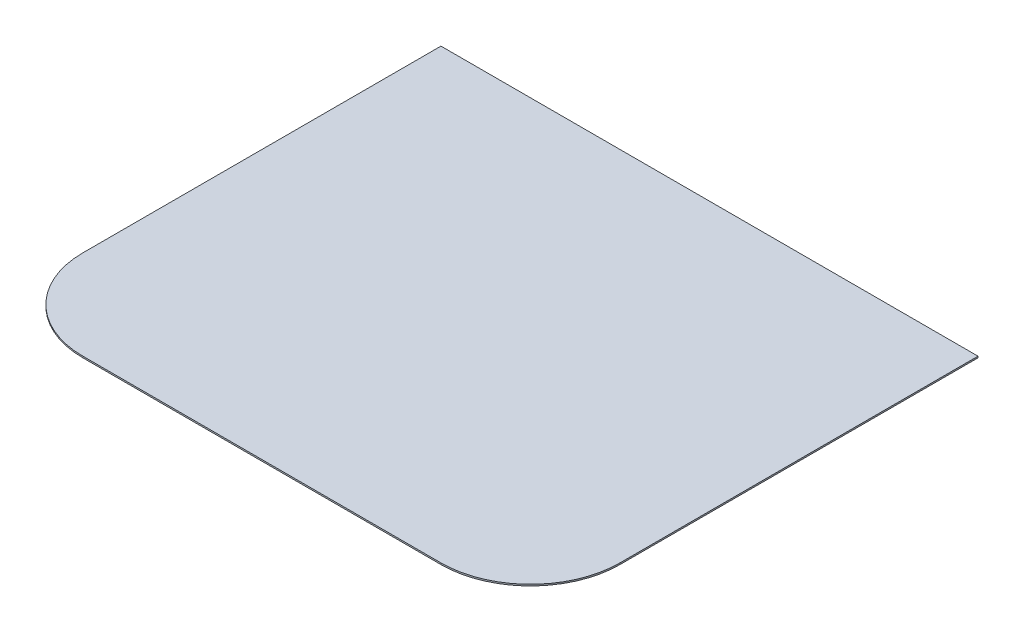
from build123d import *

# Parameters (mm, degrees)
SKETCH1_W           = 914.4
SKETCH1_H           = 762
BOSS_EXTRUDE1_DEPTH = 2.54
CUT_EXTRUDE1_DEPTH  = 2.54


with BuildPart() as part:
    # Sketch1 → Boss-Extrude1 (new body)
    with BuildSketch(Plane(origin=(0, 0, 0), x_dir=(1, 0, 0), z_dir=(0, 1, 0))):
        with Locations((457.2, 381)):
            Rectangle(SKETCH1_W, SKETCH1_H)
    extrude(amount=BOSS_EXTRUDE1_DEPTH)

    # Sketch2 → Cut-Extrude1 (cut)
    with BuildSketch(Plane(origin=(0, 2.54, 0), x_dir=(1, 0, 0), z_dir=(0, 1, 0))):
        with BuildLine():
            Line((0, 152.4), (0, 0))
            Line((0, 0), (152.4, 0))
            ThreePointArc((152.4, 0), (44.636926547, 44.636926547), (0, 152.4))
        make_face()
        with BuildLine():
            Line((914.4, 0), (762, 0))
            ThreePointArc((762, 0), (869.763073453, 44.636926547), (914.4, 152.4))
            Line((914.4, 152.4), (914.4, 0))
        make_face()
    extrude(amount=-CUT_EXTRUDE1_DEPTH, mode=Mode.SUBTRACT)


solid = part.part
